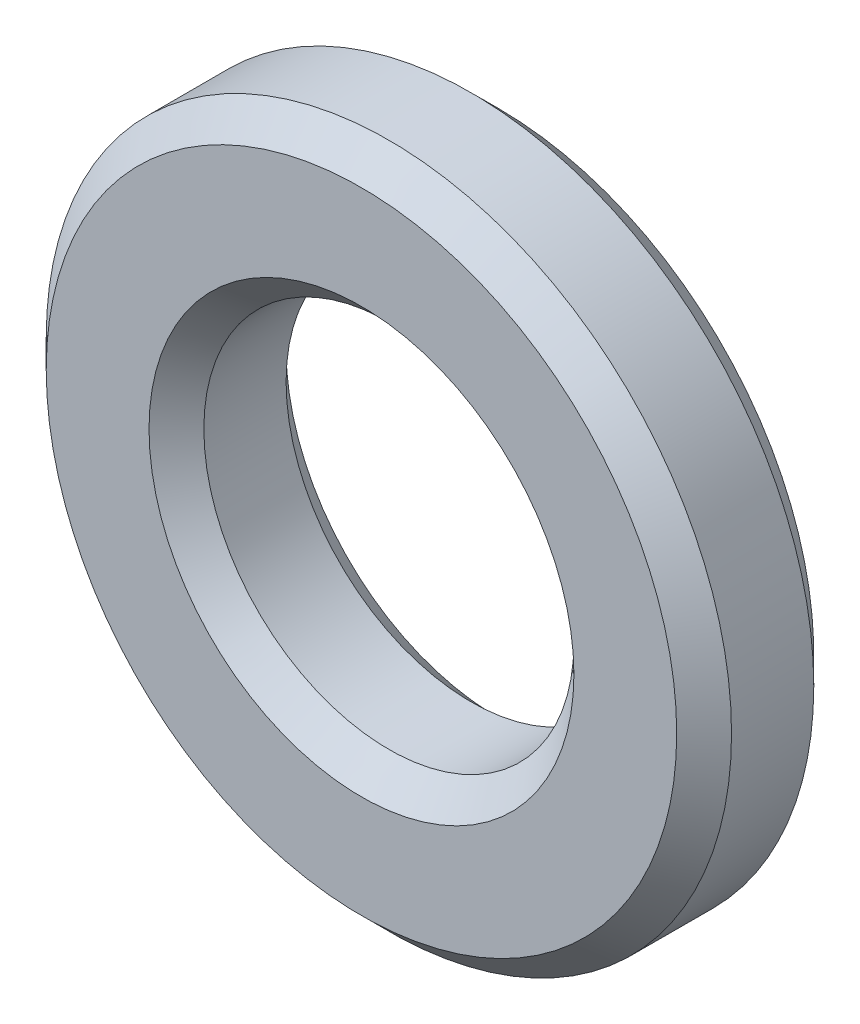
ISO-10303-21;
HEADER;
FILE_DESCRIPTION(('STEP AP214'),'2;1');
FILE_NAME('part.step','',(''),(''),'','','');
FILE_SCHEMA(('AUTOMOTIVE_DESIGN { 1 0 10303 214 1 1 1 1 }'));
ENDSEC;
DATA;
#1=APPLICATION_CONTEXT('core data for automotive mechanical design processes');
#2=APPLICATION_PROTOCOL_DEFINITION('international standard','automotive_design',2000,#1);
#3=PRODUCT_CONTEXT('',#1,'mechanical');
#4=PRODUCT('Part','Part','',(#3));
#5=PRODUCT_RELATED_PRODUCT_CATEGORY('part','',(#4));
#6=PRODUCT_DEFINITION_FORMATION('','',#4);
#7=PRODUCT_DEFINITION_CONTEXT('part definition',#1,'design');
#8=PRODUCT_DEFINITION('design','',#6,#7);
#9=PRODUCT_DEFINITION_SHAPE('','',#8);
#10=(LENGTH_UNIT() NAMED_UNIT(*) SI_UNIT(.MILLI.,.METRE.));
#11=(NAMED_UNIT(*) PLANE_ANGLE_UNIT() SI_UNIT($,.RADIAN.));
#12=(NAMED_UNIT(*) SI_UNIT($,.STERADIAN.) SOLID_ANGLE_UNIT());
#13=UNCERTAINTY_MEASURE_WITH_UNIT(LENGTH_MEASURE(1.E-05),#10,'distance_accuracy_value','');
#14=(GEOMETRIC_REPRESENTATION_CONTEXT(3) GLOBAL_UNCERTAINTY_ASSIGNED_CONTEXT((#13)) GLOBAL_UNIT_ASSIGNED_CONTEXT((#10,
#11,#12)) REPRESENTATION_CONTEXT('',''));
#15=CARTESIAN_POINT('',(0.,0.,0.));
#16=DIRECTION('',(0.,0.,1.));
#17=DIRECTION('',(1.,0.,0.));
#18=AXIS2_PLACEMENT_3D('',#15,#16,#17);
#19=CARTESIAN_POINT('',(0.,0.,0.));
#20=DIRECTION('',(0.,0.,1.));
#21=DIRECTION('',(1.,0.,0.));
#22=AXIS2_PLACEMENT_3D('',#19,#20,#21);
#23=CYLINDRICAL_SURFACE('',#22,6.75);
#24=CARTESIAN_POINT('',(0.,0.,4.00000000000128));
#25=DIRECTION('',(0.,0.,1.));
#26=DIRECTION('',(-1.,0.,0.));
#27=AXIS2_PLACEMENT_3D('',#24,#25,#26);
#28=CIRCLE('',#27,6.74999999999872);
#29=CARTESIAN_POINT('',(-6.74999999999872,0.,4.00000000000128));
#30=VERTEX_POINT('',#29);
#31=EDGE_CURVE('E36',#30,#30,#28,.T.);
#32=ORIENTED_EDGE('',*,*,#31,.T.);
#33=EDGE_LOOP('',(#32));
#34=FACE_BOUND('',#33,.T.);
#35=CARTESIAN_POINT('',(0.,0.,0.999999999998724));
#36=DIRECTION('',(0.,0.,-1.));
#37=DIRECTION('',(-1.,0.,0.));
#38=AXIS2_PLACEMENT_3D('',#35,#36,#37);
#39=CIRCLE('',#38,6.74999999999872);
#40=CARTESIAN_POINT('',(-6.74999999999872,0.,0.999999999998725));
#41=VERTEX_POINT('',#40);
#42=EDGE_CURVE('E33',#41,#41,#39,.T.);
#43=ORIENTED_EDGE('',*,*,#42,.T.);
#44=EDGE_LOOP('',(#43));
#45=FACE_BOUND('',#44,.T.);
#46=ADVANCED_FACE('F14',(#34,#45),#23,.F.);
#47=CARTESIAN_POINT('',(0.,0.,4.99999999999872));
#48=DIRECTION('',(0.,0.,1.));
#49=DIRECTION('',(1.,0.,0.));
#50=AXIS2_PLACEMENT_3D('',#47,#48,#49);
#51=CONICAL_SURFACE('',#50,7.75000000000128,0.7853981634);
#52=CARTESIAN_POINT('',(0.,0.,4.99999999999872));
#53=DIRECTION('',(0.,0.,1.));
#54=DIRECTION('',(1.,0.,0.));
#55=AXIS2_PLACEMENT_3D('',#52,#53,#54);
#56=CIRCLE('',#55,7.75000000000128);
#57=CARTESIAN_POINT('',(7.75000000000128,0.,4.99999999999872));
#58=VERTEX_POINT('',#57);
#59=EDGE_CURVE('E17',#58,#58,#56,.F.);
#60=ORIENTED_EDGE('',*,*,#59,.F.);
#61=EDGE_LOOP('',(#60));
#62=FACE_BOUND('',#61,.T.);
#63=ORIENTED_EDGE('',*,*,#31,.F.);
#64=EDGE_LOOP('',(#63));
#65=FACE_BOUND('',#64,.T.);
#66=ADVANCED_FACE('F56',(#62,#65),#51,.F.);
#67=CARTESIAN_POINT('',(0.,0.,1.27632279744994E-12));
#68=DIRECTION('',(0.,0.,-1.));
#69=DIRECTION('',(-1.,0.,0.));
#70=AXIS2_PLACEMENT_3D('',#67,#68,#69);
#71=CONICAL_SURFACE('',#70,7.75000000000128,0.7853981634);
#72=CARTESIAN_POINT('',(0.,0.,1.27632279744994E-12));
#73=DIRECTION('',(0.,0.,-1.));
#74=DIRECTION('',(-1.,0.,0.));
#75=AXIS2_PLACEMENT_3D('',#72,#73,#74);
#76=CIRCLE('',#75,7.75000000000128);
#77=CARTESIAN_POINT('',(-7.75000000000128,0.,1.27632279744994E-12));
#78=VERTEX_POINT('',#77);
#79=EDGE_CURVE('E47',#78,#78,#76,.T.);
#80=ORIENTED_EDGE('',*,*,#79,.T.);
#81=EDGE_LOOP('',(#80));
#82=FACE_BOUND('',#81,.T.);
#83=ORIENTED_EDGE('',*,*,#42,.F.);
#84=EDGE_LOOP('',(#83));
#85=FACE_BOUND('',#84,.T.);
#86=ADVANCED_FACE('F59',(#82,#85),#71,.F.);
#87=CARTESIAN_POINT('',(0.,0.,5.));
#88=DIRECTION('',(0.,0.,1.));
#89=DIRECTION('',(1.,0.,0.));
#90=AXIS2_PLACEMENT_3D('',#87,#88,#89);
#91=PLANE('',#90);
#92=CARTESIAN_POINT('',(0.,0.,4.99999999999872));
#93=DIRECTION('',(0.,0.,-1.));
#94=DIRECTION('',(-1.,0.,0.));
#95=AXIS2_PLACEMENT_3D('',#92,#93,#94);
#96=CIRCLE('',#95,11.4999999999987);
#97=CARTESIAN_POINT('',(-11.4999999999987,0.,4.99999999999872));
#98=VERTEX_POINT('',#97);
#99=EDGE_CURVE('E45',#98,#98,#96,.T.);
#100=ORIENTED_EDGE('',*,*,#99,.F.);
#101=EDGE_LOOP('',(#100));
#102=FACE_BOUND('',#101,.T.);
#103=ORIENTED_EDGE('',*,*,#59,.T.);
#104=EDGE_LOOP('',(#103));
#105=FACE_BOUND('',#104,.T.);
#106=ADVANCED_FACE('F54',(#102,#105),#91,.T.);
#107=CARTESIAN_POINT('',(0.,0.,0.));
#108=DIRECTION('',(0.,0.,1.));
#109=DIRECTION('',(1.,0.,0.));
#110=AXIS2_PLACEMENT_3D('',#107,#108,#109);
#111=PLANE('',#110);
#112=CARTESIAN_POINT('',(0.,0.,1.27653963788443E-12));
#113=DIRECTION('',(0.,0.,1.));
#114=DIRECTION('',(0.,-1.,0.));
#115=AXIS2_PLACEMENT_3D('',#112,#113,#114);
#116=CIRCLE('',#115,11.4999999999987);
#117=CARTESIAN_POINT('',(0.,-11.4999999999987,1.27643989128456E-12));
#118=VERTEX_POINT('',#117);
#119=EDGE_CURVE('E26',#118,#118,#116,.T.);
#120=ORIENTED_EDGE('',*,*,#119,.F.);
#121=EDGE_LOOP('',(#120));
#122=FACE_BOUND('',#121,.T.);
#123=ORIENTED_EDGE('',*,*,#79,.F.);
#124=EDGE_LOOP('',(#123));
#125=FACE_BOUND('',#124,.T.);
#126=ADVANCED_FACE('F72',(#122,#125),#111,.F.);
#127=CARTESIAN_POINT('',(0.,0.,4.00000000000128));
#128=DIRECTION('',(0.,0.,-1.));
#129=DIRECTION('',(-1.,0.,0.));
#130=AXIS2_PLACEMENT_3D('',#127,#128,#129);
#131=CONICAL_SURFACE('',#130,12.5000000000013,0.785398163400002);
#132=ORIENTED_EDGE('',*,*,#99,.T.);
#133=EDGE_LOOP('',(#132));
#134=FACE_BOUND('',#133,.T.);
#135=CARTESIAN_POINT('',(0.,0.,4.));
#136=DIRECTION('',(0.,0.,1.));
#137=DIRECTION('',(1.,0.,0.));
#138=AXIS2_PLACEMENT_3D('',#135,#136,#137);
#139=CIRCLE('',#138,12.5);
#140=CARTESIAN_POINT('',(12.5,0.,4.));
#141=VERTEX_POINT('',#140);
#142=EDGE_CURVE('E21',#141,#141,#139,.F.);
#143=ORIENTED_EDGE('',*,*,#142,.F.);
#144=EDGE_LOOP('',(#143));
#145=FACE_BOUND('',#144,.T.);
#146=ADVANCED_FACE('F82',(#134,#145),#131,.T.);
#147=CARTESIAN_POINT('',(0.,0.,0.999999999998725));
#148=DIRECTION('',(0.,0.,1.));
#149=DIRECTION('',(0.,-1.,0.));
#150=AXIS2_PLACEMENT_3D('',#147,#148,#149);
#151=CONICAL_SURFACE('',#150,12.5000000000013,0.7853981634);
#152=ORIENTED_EDGE('',*,*,#119,.T.);
#153=EDGE_LOOP('',(#152));
#154=FACE_BOUND('',#153,.T.);
#155=CARTESIAN_POINT('',(0.,0.,1.));
#156=DIRECTION('',(0.,0.,1.));
#157=DIRECTION('',(1.,0.,0.));
#158=AXIS2_PLACEMENT_3D('',#155,#156,#157);
#159=CIRCLE('',#158,12.5);
#160=CARTESIAN_POINT('',(12.5,0.,1.));
#161=VERTEX_POINT('',#160);
#162=EDGE_CURVE('E10',#161,#161,#159,.T.);
#163=ORIENTED_EDGE('',*,*,#162,.F.);
#164=EDGE_LOOP('',(#163));
#165=FACE_BOUND('',#164,.T.);
#166=ADVANCED_FACE('F77',(#154,#165),#151,.T.);
#167=CARTESIAN_POINT('',(0.,0.,0.));
#168=DIRECTION('',(0.,0.,1.));
#169=DIRECTION('',(1.,0.,0.));
#170=AXIS2_PLACEMENT_3D('',#167,#168,#169);
#171=CYLINDRICAL_SURFACE('',#170,12.5);
#172=ORIENTED_EDGE('',*,*,#162,.T.);
#173=EDGE_LOOP('',(#172));
#174=FACE_BOUND('',#173,.T.);
#175=ORIENTED_EDGE('',*,*,#142,.T.);
#176=EDGE_LOOP('',(#175));
#177=FACE_BOUND('',#176,.T.);
#178=ADVANCED_FACE('F75',(#174,#177),#171,.T.);
#179=CLOSED_SHELL('',(#46,#66,#86,#106,#126,#146,#166,#178));
#180=MANIFOLD_SOLID_BREP('B1',#179);
#181=ADVANCED_BREP_SHAPE_REPRESENTATION('',(#18,#180),#14);
#182=SHAPE_DEFINITION_REPRESENTATION(#9,#181);
ENDSEC;
END-ISO-10303-21;
